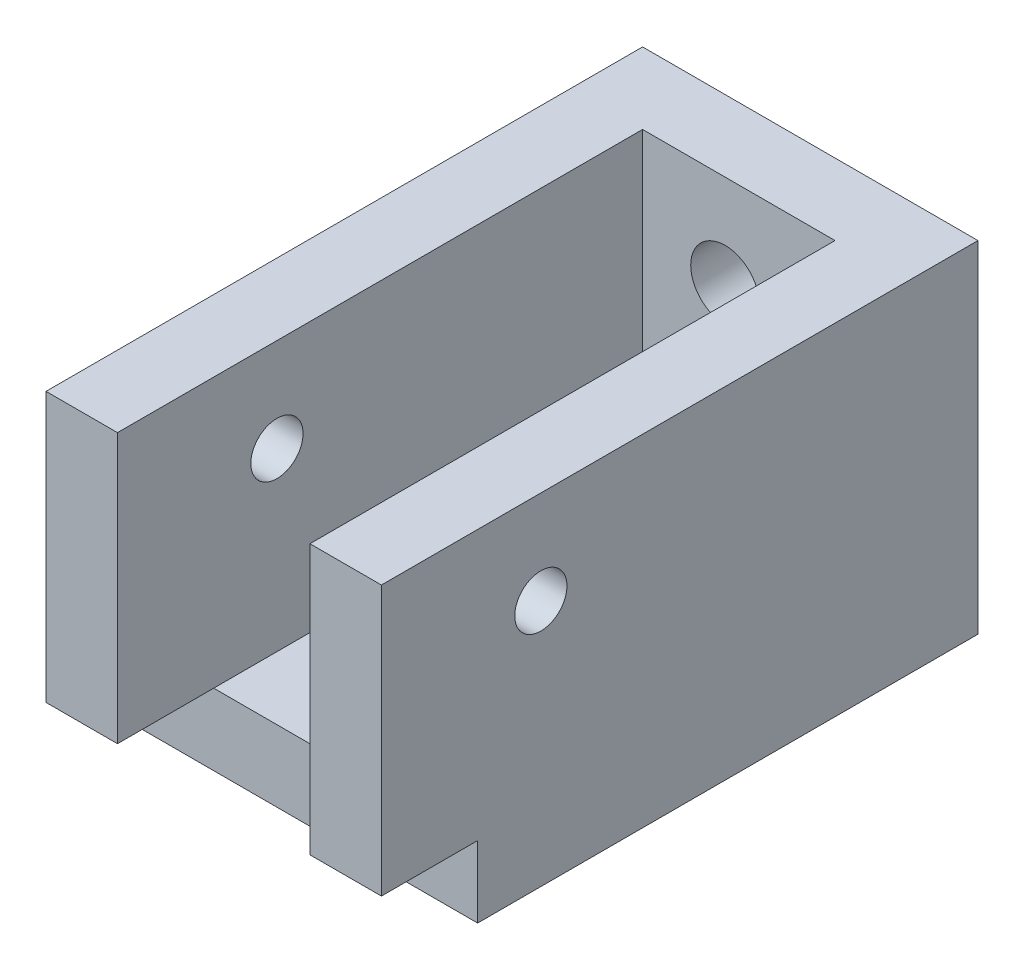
ISO-10303-21;
HEADER;
FILE_DESCRIPTION(('STEP AP214'),'2;1');
FILE_NAME('part.step','',(''),(''),'','','');
FILE_SCHEMA(('AUTOMOTIVE_DESIGN { 1 0 10303 214 1 1 1 1 }'));
ENDSEC;
DATA;
#1=APPLICATION_CONTEXT('core data for automotive mechanical design processes');
#2=APPLICATION_PROTOCOL_DEFINITION('international standard','automotive_design',2000,#1);
#3=PRODUCT_CONTEXT('',#1,'mechanical');
#4=PRODUCT('Part','Part','',(#3));
#5=PRODUCT_RELATED_PRODUCT_CATEGORY('part','',(#4));
#6=PRODUCT_DEFINITION_FORMATION('','',#4);
#7=PRODUCT_DEFINITION_CONTEXT('part definition',#1,'design');
#8=PRODUCT_DEFINITION('design','',#6,#7);
#9=PRODUCT_DEFINITION_SHAPE('','',#8);
#10=(LENGTH_UNIT() NAMED_UNIT(*) SI_UNIT(.MILLI.,.METRE.));
#11=(NAMED_UNIT(*) PLANE_ANGLE_UNIT() SI_UNIT($,.RADIAN.));
#12=(NAMED_UNIT(*) SI_UNIT($,.STERADIAN.) SOLID_ANGLE_UNIT());
#13=UNCERTAINTY_MEASURE_WITH_UNIT(LENGTH_MEASURE(1.E-05),#10,'distance_accuracy_value','');
#14=(GEOMETRIC_REPRESENTATION_CONTEXT(3) GLOBAL_UNCERTAINTY_ASSIGNED_CONTEXT((#13)) GLOBAL_UNIT_ASSIGNED_CONTEXT((#10,
#11,#12)) REPRESENTATION_CONTEXT('',''));
#15=CARTESIAN_POINT('',(0.,0.,0.));
#16=DIRECTION('',(0.,0.,1.));
#17=DIRECTION('',(1.,0.,0.));
#18=AXIS2_PLACEMENT_3D('',#15,#16,#17);
#19=CARTESIAN_POINT('',(0.,124.,26.));
#20=DIRECTION('',(0.,0.,-1.));
#21=DIRECTION('',(-1.,0.,0.));
#22=AXIS2_PLACEMENT_3D('',#19,#20,#21);
#23=PLANE('',#22);
#24=CARTESIAN_POINT('',(56.,90.,26.));
#25=DIRECTION('',(0.,0.,-1.));
#26=DIRECTION('',(-1.,0.,0.));
#27=AXIS2_PLACEMENT_3D('',#24,#25,#26);
#28=CIRCLE('',#27,12.5);
#29=CARTESIAN_POINT('',(43.5,90.,26.));
#30=VERTEX_POINT('',#29);
#31=EDGE_CURVE('E139',#30,#30,#28,.T.);
#32=ORIENTED_EDGE('',*,*,#31,.T.);
#33=EDGE_LOOP('',(#32));
#34=FACE_BOUND('',#33,.T.);
#35=DIRECTION('',(-1.,0.,0.));
#36=VECTOR('',#35,1.);
#37=CARTESIAN_POINT('',(0.,26.,26.));
#38=LINE('',#37,#36);
#39=CARTESIAN_POINT('',(96.,26.,26.));
#40=VERTEX_POINT('',#39);
#41=CARTESIAN_POINT('',(26.,26.,26.));
#42=VERTEX_POINT('',#41);
#43=EDGE_CURVE('E136',#40,#42,#38,.T.);
#44=ORIENTED_EDGE('',*,*,#43,.F.);
#45=DIRECTION('',(0.,-1.,0.));
#46=VECTOR('',#45,1.);
#47=CARTESIAN_POINT('',(96.,124.,26.));
#48=LINE('',#47,#46);
#49=CARTESIAN_POINT('',(96.,124.,26.));
#50=VERTEX_POINT('',#49);
#51=EDGE_CURVE('E152',#50,#40,#48,.T.);
#52=ORIENTED_EDGE('',*,*,#51,.F.);
#53=DIRECTION('',(-1.,0.,0.));
#54=VECTOR('',#53,1.);
#55=CARTESIAN_POINT('',(0.,124.,26.));
#56=LINE('',#55,#54);
#57=CARTESIAN_POINT('',(26.,124.,26.));
#58=VERTEX_POINT('',#57);
#59=EDGE_CURVE('E198',#50,#58,#56,.T.);
#60=ORIENTED_EDGE('',*,*,#59,.T.);
#61=DIRECTION('',(0.,1.,0.));
#62=VECTOR('',#61,1.);
#63=CARTESIAN_POINT('',(26.,124.,26.));
#64=LINE('',#63,#62);
#65=EDGE_CURVE('E173',#42,#58,#64,.T.);
#66=ORIENTED_EDGE('',*,*,#65,.F.);
#67=EDGE_LOOP('',(#44,#52,#60,#66));
#68=FACE_BOUND('',#67,.T.);
#69=ADVANCED_FACE('F34',(#34,#68),#23,.F.);
#70=CARTESIAN_POINT('',(0.,26.,217.));
#71=DIRECTION('',(0.,1.,0.));
#72=DIRECTION('',(0.,0.,1.));
#73=AXIS2_PLACEMENT_3D('',#70,#71,#72);
#74=PLANE('',#73);
#75=DIRECTION('',(-1.,0.,0.));
#76=VECTOR('',#75,1.);
#77=CARTESIAN_POINT('',(0.,26.,182.));
#78=LINE('',#77,#76);
#79=CARTESIAN_POINT('',(26.,26.,182.));
#80=VERTEX_POINT('',#79);
#81=CARTESIAN_POINT('',(0.,26.,182.));
#82=VERTEX_POINT('',#81);
#83=EDGE_CURVE('E55',#80,#82,#78,.T.);
#84=ORIENTED_EDGE('',*,*,#83,.F.);
#85=DIRECTION('',(0.,0.,-1.));
#86=VECTOR('',#85,1.);
#87=CARTESIAN_POINT('',(26.,26.,217.));
#88=LINE('',#87,#86);
#89=CARTESIAN_POINT('',(26.,26.,217.));
#90=VERTEX_POINT('',#89);
#91=EDGE_CURVE('E187',#90,#80,#88,.T.);
#92=ORIENTED_EDGE('',*,*,#91,.F.);
#93=DIRECTION('',(1.,0.,0.));
#94=VECTOR('',#93,1.);
#95=CARTESIAN_POINT('',(0.,26.,217.));
#96=LINE('',#95,#94);
#97=CARTESIAN_POINT('',(0.,26.,217.));
#98=VERTEX_POINT('',#97);
#99=EDGE_CURVE('E177',#98,#90,#96,.T.);
#100=ORIENTED_EDGE('',*,*,#99,.F.);
#101=DIRECTION('',(0.,0.,-1.));
#102=VECTOR('',#101,1.);
#103=CARTESIAN_POINT('',(0.,26.,217.));
#104=LINE('',#103,#102);
#105=EDGE_CURVE('E51',#98,#82,#104,.T.);
#106=ORIENTED_EDGE('',*,*,#105,.T.);
#107=EDGE_LOOP('',(#84,#92,#100,#106));
#108=FACE_BOUND('',#107,.T.);
#109=ADVANCED_FACE('F263',(#108),#74,.F.);
#110=CARTESIAN_POINT('',(122.,26.,217.));
#111=DIRECTION('',(0.,1.,0.));
#112=DIRECTION('',(-1.,0.,0.));
#113=AXIS2_PLACEMENT_3D('',#110,#111,#112);
#114=PLANE('',#113);
#115=CARTESIAN_POINT('',(122.,26.,182.));
#116=VERTEX_POINT('',#115);
#117=CARTESIAN_POINT('',(96.,26.,182.));
#118=VERTEX_POINT('',#117);
#119=EDGE_CURVE('E145',#116,#118,#78,.T.);
#120=ORIENTED_EDGE('',*,*,#119,.F.);
#121=DIRECTION('',(0.,0.,-1.));
#122=VECTOR('',#121,1.);
#123=CARTESIAN_POINT('',(122.,26.,217.));
#124=LINE('',#123,#122);
#125=CARTESIAN_POINT('',(122.,26.,217.));
#126=VERTEX_POINT('',#125);
#127=EDGE_CURVE('E162',#126,#116,#124,.T.);
#128=ORIENTED_EDGE('',*,*,#127,.F.);
#129=DIRECTION('',(1.,0.,0.));
#130=VECTOR('',#129,1.);
#131=CARTESIAN_POINT('',(122.,26.,217.));
#132=LINE('',#131,#130);
#133=CARTESIAN_POINT('',(96.,26.,217.));
#134=VERTEX_POINT('',#133);
#135=EDGE_CURVE('E160',#134,#126,#132,.T.);
#136=ORIENTED_EDGE('',*,*,#135,.F.);
#137=DIRECTION('',(0.,0.,-1.));
#138=VECTOR('',#137,1.);
#139=CARTESIAN_POINT('',(96.,26.,217.));
#140=LINE('',#139,#138);
#141=EDGE_CURVE('E168',#134,#118,#140,.T.);
#142=ORIENTED_EDGE('',*,*,#141,.T.);
#143=EDGE_LOOP('',(#120,#128,#136,#142));
#144=FACE_BOUND('',#143,.T.);
#145=ADVANCED_FACE('F224',(#144),#114,.F.);
#146=CARTESIAN_POINT('',(0.,0.,26.));
#147=DIRECTION('',(1.,0.,0.));
#148=DIRECTION('',(0.,0.,-1.));
#149=AXIS2_PLACEMENT_3D('',#146,#147,#148);
#150=PLANE('',#149);
#151=CARTESIAN_POINT('',(0.,90.,159.));
#152=DIRECTION('',(-1.,0.,0.));
#153=DIRECTION('',(0.,0.,1.));
#154=AXIS2_PLACEMENT_3D('',#151,#152,#153);
#155=CIRCLE('',#154,9.50000000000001);
#156=CARTESIAN_POINT('',(0.,90.,168.5));
#157=VERTEX_POINT('',#156);
#158=EDGE_CURVE('E299',#157,#157,#155,.T.);
#159=ORIENTED_EDGE('',*,*,#158,.F.);
#160=EDGE_LOOP('',(#159));
#161=FACE_BOUND('',#160,.T.);
#162=DIRECTION('',(0.,0.,-1.));
#163=VECTOR('',#162,1.);
#164=CARTESIAN_POINT('',(0.,0.,26.));
#165=LINE('',#164,#163);
#166=CARTESIAN_POINT('',(0.,0.,182.));
#167=VERTEX_POINT('',#166);
#168=CARTESIAN_POINT('',(0.,0.,0.));
#169=VERTEX_POINT('',#168);
#170=EDGE_CURVE('E11',#167,#169,#165,.T.);
#171=ORIENTED_EDGE('',*,*,#170,.F.);
#172=DIRECTION('',(0.,-1.,0.));
#173=VECTOR('',#172,1.);
#174=CARTESIAN_POINT('',(0.,0.,182.));
#175=LINE('',#174,#173);
#176=EDGE_CURVE('E120',#82,#167,#175,.T.);
#177=ORIENTED_EDGE('',*,*,#176,.F.);
#178=ORIENTED_EDGE('',*,*,#105,.F.);
#179=DIRECTION('',(0.,-1.,0.));
#180=VECTOR('',#179,1.);
#181=CARTESIAN_POINT('',(0.,124.,217.));
#182=LINE('',#181,#180);
#183=CARTESIAN_POINT('',(0.,124.,217.));
#184=VERTEX_POINT('',#183);
#185=EDGE_CURVE('E174',#184,#98,#182,.T.);
#186=ORIENTED_EDGE('',*,*,#185,.F.);
#187=DIRECTION('',(0.,0.,-1.));
#188=VECTOR('',#187,1.);
#189=CARTESIAN_POINT('',(0.,124.,26.));
#190=LINE('',#189,#188);
#191=CARTESIAN_POINT('',(0.,124.,0.));
#192=VERTEX_POINT('',#191);
#193=EDGE_CURVE('E199',#184,#192,#190,.T.);
#194=ORIENTED_EDGE('',*,*,#193,.T.);
#195=DIRECTION('',(0.,-1.,0.));
#196=VECTOR('',#195,1.);
#197=CARTESIAN_POINT('',(0.,0.,0.));
#198=LINE('',#197,#196);
#199=EDGE_CURVE('E123',#192,#169,#198,.T.);
#200=ORIENTED_EDGE('',*,*,#199,.T.);
#201=EDGE_LOOP('',(#171,#177,#178,#186,#194,#200));
#202=FACE_BOUND('',#201,.T.);
#203=ADVANCED_FACE('F36',(#161,#202),#150,.F.);
#204=CARTESIAN_POINT('',(0.,0.,26.));
#205=DIRECTION('',(0.,1.,0.));
#206=DIRECTION('',(0.,0.,1.));
#207=AXIS2_PLACEMENT_3D('',#204,#205,#206);
#208=PLANE('',#207);
#209=DIRECTION('',(1.,0.,0.));
#210=VECTOR('',#209,1.);
#211=CARTESIAN_POINT('',(0.,0.,0.));
#212=LINE('',#211,#210);
#213=CARTESIAN_POINT('',(122.,0.,0.));
#214=VERTEX_POINT('',#213);
#215=EDGE_CURVE('E204',#169,#214,#212,.T.);
#216=ORIENTED_EDGE('',*,*,#215,.T.);
#217=DIRECTION('',(0.,0.,-1.));
#218=VECTOR('',#217,1.);
#219=CARTESIAN_POINT('',(122.,0.,26.));
#220=LINE('',#219,#218);
#221=CARTESIAN_POINT('',(122.,0.,182.));
#222=VERTEX_POINT('',#221);
#223=EDGE_CURVE('E43',#222,#214,#220,.T.);
#224=ORIENTED_EDGE('',*,*,#223,.F.);
#225=DIRECTION('',(1.,0.,0.));
#226=VECTOR('',#225,1.);
#227=CARTESIAN_POINT('',(0.,0.,182.));
#228=LINE('',#227,#226);
#229=EDGE_CURVE('E126',#167,#222,#228,.T.);
#230=ORIENTED_EDGE('',*,*,#229,.F.);
#231=ORIENTED_EDGE('',*,*,#170,.T.);
#232=EDGE_LOOP('',(#216,#224,#230,#231));
#233=FACE_BOUND('',#232,.T.);
#234=ADVANCED_FACE('F127',(#233),#208,.F.);
#235=CARTESIAN_POINT('',(122.,0.,26.));
#236=DIRECTION('',(-1.,0.,0.));
#237=DIRECTION('',(0.,0.,1.));
#238=AXIS2_PLACEMENT_3D('',#235,#236,#237);
#239=PLANE('',#238);
#240=CARTESIAN_POINT('',(122.,90.,159.));
#241=DIRECTION('',(-1.,0.,0.));
#242=DIRECTION('',(0.,0.,1.));
#243=AXIS2_PLACEMENT_3D('',#240,#241,#242);
#244=CIRCLE('',#243,9.50000000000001);
#245=CARTESIAN_POINT('',(122.,90.,168.5));
#246=VERTEX_POINT('',#245);
#247=EDGE_CURVE('E307',#246,#246,#244,.T.);
#248=ORIENTED_EDGE('',*,*,#247,.T.);
#249=EDGE_LOOP('',(#248));
#250=FACE_BOUND('',#249,.T.);
#251=DIRECTION('',(0.,1.,0.));
#252=VECTOR('',#251,1.);
#253=CARTESIAN_POINT('',(122.,0.,0.));
#254=LINE('',#253,#252);
#255=CARTESIAN_POINT('',(122.,124.,0.));
#256=VERTEX_POINT('',#255);
#257=EDGE_CURVE('E206',#214,#256,#254,.T.);
#258=ORIENTED_EDGE('',*,*,#257,.T.);
#259=DIRECTION('',(0.,0.,-1.));
#260=VECTOR('',#259,1.);
#261=CARTESIAN_POINT('',(122.,124.,26.));
#262=LINE('',#261,#260);
#263=CARTESIAN_POINT('',(122.,124.,217.));
#264=VERTEX_POINT('',#263);
#265=EDGE_CURVE('E210',#264,#256,#262,.T.);
#266=ORIENTED_EDGE('',*,*,#265,.F.);
#267=DIRECTION('',(0.,1.,0.));
#268=VECTOR('',#267,1.);
#269=CARTESIAN_POINT('',(122.,124.,217.));
#270=LINE('',#269,#268);
#271=EDGE_CURVE('E153',#126,#264,#270,.T.);
#272=ORIENTED_EDGE('',*,*,#271,.F.);
#273=ORIENTED_EDGE('',*,*,#127,.T.);
#274=DIRECTION('',(0.,1.,0.));
#275=VECTOR('',#274,1.);
#276=CARTESIAN_POINT('',(122.,0.,182.));
#277=LINE('',#276,#275);
#278=EDGE_CURVE('E132',#222,#116,#277,.T.);
#279=ORIENTED_EDGE('',*,*,#278,.F.);
#280=ORIENTED_EDGE('',*,*,#223,.T.);
#281=EDGE_LOOP('',(#258,#266,#272,#273,#279,#280));
#282=FACE_BOUND('',#281,.T.);
#283=ADVANCED_FACE('F230',(#250,#282),#239,.F.);
#284=CARTESIAN_POINT('',(0.,124.,26.));
#285=DIRECTION('',(0.,-1.,0.));
#286=DIRECTION('',(0.,0.,-1.));
#287=AXIS2_PLACEMENT_3D('',#284,#285,#286);
#288=PLANE('',#287);
#289=DIRECTION('',(-1.,0.,0.));
#290=VECTOR('',#289,1.);
#291=CARTESIAN_POINT('',(0.,124.,0.));
#292=LINE('',#291,#290);
#293=EDGE_CURVE('E200',#256,#192,#292,.T.);
#294=ORIENTED_EDGE('',*,*,#293,.T.);
#295=ORIENTED_EDGE('',*,*,#193,.F.);
#296=DIRECTION('',(-1.,0.,0.));
#297=VECTOR('',#296,1.);
#298=CARTESIAN_POINT('',(0.,124.,217.));
#299=LINE('',#298,#297);
#300=CARTESIAN_POINT('',(26.,124.,217.));
#301=VERTEX_POINT('',#300);
#302=EDGE_CURVE('E181',#301,#184,#299,.T.);
#303=ORIENTED_EDGE('',*,*,#302,.F.);
#304=DIRECTION('',(0.,0.,-1.));
#305=VECTOR('',#304,1.);
#306=CARTESIAN_POINT('',(26.,124.,217.));
#307=LINE('',#306,#305);
#308=EDGE_CURVE('E184',#301,#58,#307,.T.);
#309=ORIENTED_EDGE('',*,*,#308,.T.);
#310=ORIENTED_EDGE('',*,*,#59,.F.);
#311=DIRECTION('',(0.,0.,-1.));
#312=VECTOR('',#311,1.);
#313=CARTESIAN_POINT('',(96.,124.,217.));
#314=LINE('',#313,#312);
#315=CARTESIAN_POINT('',(96.,124.,217.));
#316=VERTEX_POINT('',#315);
#317=EDGE_CURVE('E170',#316,#50,#314,.T.);
#318=ORIENTED_EDGE('',*,*,#317,.F.);
#319=DIRECTION('',(-1.,0.,0.));
#320=VECTOR('',#319,1.);
#321=CARTESIAN_POINT('',(122.,124.,217.));
#322=LINE('',#321,#320);
#323=EDGE_CURVE('E156',#264,#316,#322,.T.);
#324=ORIENTED_EDGE('',*,*,#323,.F.);
#325=ORIENTED_EDGE('',*,*,#265,.T.);
#326=EDGE_LOOP('',(#294,#295,#303,#309,#310,#318,#324,#325));
#327=FACE_BOUND('',#326,.T.);
#328=ADVANCED_FACE('F242',(#327),#288,.F.);
#329=CARTESIAN_POINT('',(0.,124.,0.));
#330=DIRECTION('',(0.,0.,-1.));
#331=DIRECTION('',(-1.,0.,0.));
#332=AXIS2_PLACEMENT_3D('',#329,#330,#331);
#333=PLANE('',#332);
#334=CARTESIAN_POINT('',(56.,90.,0.));
#335=DIRECTION('',(0.,0.,-1.));
#336=DIRECTION('',(-1.,0.,0.));
#337=AXIS2_PLACEMENT_3D('',#334,#335,#336);
#338=CIRCLE('',#337,12.5);
#339=CARTESIAN_POINT('',(43.5,90.,0.));
#340=VERTEX_POINT('',#339);
#341=EDGE_CURVE('E303',#340,#340,#338,.T.);
#342=ORIENTED_EDGE('',*,*,#341,.F.);
#343=EDGE_LOOP('',(#342));
#344=FACE_BOUND('',#343,.T.);
#345=ORIENTED_EDGE('',*,*,#199,.F.);
#346=ORIENTED_EDGE('',*,*,#293,.F.);
#347=ORIENTED_EDGE('',*,*,#257,.F.);
#348=ORIENTED_EDGE('',*,*,#215,.F.);
#349=EDGE_LOOP('',(#345,#346,#347,#348));
#350=FACE_BOUND('',#349,.T.);
#351=ADVANCED_FACE('F248',(#344,#350),#333,.T.);
#352=CARTESIAN_POINT('',(26.,124.,217.));
#353=DIRECTION('',(-1.,0.,0.));
#354=DIRECTION('',(0.,0.,1.));
#355=AXIS2_PLACEMENT_3D('',#352,#353,#354);
#356=PLANE('',#355);
#357=CARTESIAN_POINT('',(26.,90.,159.));
#358=DIRECTION('',(-1.,0.,0.));
#359=DIRECTION('',(0.,0.,1.));
#360=AXIS2_PLACEMENT_3D('',#357,#358,#359);
#361=CIRCLE('',#360,9.50000000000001);
#362=CARTESIAN_POINT('',(26.,90.,168.5));
#363=VERTEX_POINT('',#362);
#364=EDGE_CURVE('E302',#363,#363,#361,.T.);
#365=ORIENTED_EDGE('',*,*,#364,.T.);
#366=EDGE_LOOP('',(#365));
#367=FACE_BOUND('',#366,.T.);
#368=ORIENTED_EDGE('',*,*,#65,.T.);
#369=ORIENTED_EDGE('',*,*,#308,.F.);
#370=DIRECTION('',(0.,1.,0.));
#371=VECTOR('',#370,1.);
#372=CARTESIAN_POINT('',(26.,124.,217.));
#373=LINE('',#372,#371);
#374=EDGE_CURVE('E179',#90,#301,#373,.T.);
#375=ORIENTED_EDGE('',*,*,#374,.F.);
#376=ORIENTED_EDGE('',*,*,#91,.T.);
#377=DIRECTION('',(0.,0.,1.));
#378=VECTOR('',#377,1.);
#379=CARTESIAN_POINT('',(26.,26.,217.));
#380=LINE('',#379,#378);
#381=EDGE_CURVE('E147',#42,#80,#380,.T.);
#382=ORIENTED_EDGE('',*,*,#381,.F.);
#383=EDGE_LOOP('',(#368,#369,#375,#376,#382));
#384=FACE_BOUND('',#383,.T.);
#385=ADVANCED_FACE('F215',(#367,#384),#356,.F.);
#386=CARTESIAN_POINT('',(0.,26.,217.));
#387=DIRECTION('',(0.,0.,1.));
#388=DIRECTION('',(1.,0.,0.));
#389=AXIS2_PLACEMENT_3D('',#386,#387,#388);
#390=PLANE('',#389);
#391=ORIENTED_EDGE('',*,*,#185,.T.);
#392=ORIENTED_EDGE('',*,*,#99,.T.);
#393=ORIENTED_EDGE('',*,*,#374,.T.);
#394=ORIENTED_EDGE('',*,*,#302,.T.);
#395=EDGE_LOOP('',(#391,#392,#393,#394));
#396=FACE_BOUND('',#395,.T.);
#397=ADVANCED_FACE('F245',(#396),#390,.T.);
#398=CARTESIAN_POINT('',(96.,124.,217.));
#399=DIRECTION('',(1.,0.,0.));
#400=DIRECTION('',(0.,0.,-1.));
#401=AXIS2_PLACEMENT_3D('',#398,#399,#400);
#402=PLANE('',#401);
#403=CARTESIAN_POINT('',(96.,90.,159.));
#404=DIRECTION('',(1.,0.,0.));
#405=DIRECTION('',(0.,0.,-1.));
#406=AXIS2_PLACEMENT_3D('',#403,#404,#405);
#407=CIRCLE('',#406,9.50000000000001);
#408=CARTESIAN_POINT('',(96.,90.,168.5));
#409=VERTEX_POINT('',#408);
#410=EDGE_CURVE('E38',#409,#409,#407,.T.);
#411=ORIENTED_EDGE('',*,*,#410,.T.);
#412=EDGE_LOOP('',(#411));
#413=FACE_BOUND('',#412,.T.);
#414=ORIENTED_EDGE('',*,*,#51,.T.);
#415=EDGE_CURVE('E167',#118,#40,#140,.T.);
#416=ORIENTED_EDGE('',*,*,#415,.F.);
#417=ORIENTED_EDGE('',*,*,#141,.F.);
#418=DIRECTION('',(0.,-1.,0.));
#419=VECTOR('',#418,1.);
#420=CARTESIAN_POINT('',(96.,124.,217.));
#421=LINE('',#420,#419);
#422=EDGE_CURVE('E158',#316,#134,#421,.T.);
#423=ORIENTED_EDGE('',*,*,#422,.F.);
#424=ORIENTED_EDGE('',*,*,#317,.T.);
#425=EDGE_LOOP('',(#414,#416,#417,#423,#424));
#426=FACE_BOUND('',#425,.T.);
#427=ADVANCED_FACE('F237',(#413,#426),#402,.F.);
#428=CARTESIAN_POINT('',(122.,124.,217.));
#429=DIRECTION('',(0.,0.,-1.));
#430=DIRECTION('',(-1.,0.,0.));
#431=AXIS2_PLACEMENT_3D('',#428,#429,#430);
#432=PLANE('',#431);
#433=ORIENTED_EDGE('',*,*,#271,.T.);
#434=ORIENTED_EDGE('',*,*,#323,.T.);
#435=ORIENTED_EDGE('',*,*,#422,.T.);
#436=ORIENTED_EDGE('',*,*,#135,.T.);
#437=EDGE_LOOP('',(#433,#434,#435,#436));
#438=FACE_BOUND('',#437,.T.);
#439=ADVANCED_FACE('F233',(#438),#432,.F.);
#440=CARTESIAN_POINT('',(0.,26.,182.));
#441=DIRECTION('',(0.,-1.,0.));
#442=DIRECTION('',(0.,0.,-1.));
#443=AXIS2_PLACEMENT_3D('',#440,#441,#442);
#444=PLANE('',#443);
#445=ORIENTED_EDGE('',*,*,#43,.T.);
#446=ORIENTED_EDGE('',*,*,#381,.T.);
#447=EDGE_CURVE('E148',#118,#80,#78,.T.);
#448=ORIENTED_EDGE('',*,*,#447,.F.);
#449=ORIENTED_EDGE('',*,*,#415,.T.);
#450=EDGE_LOOP('',(#445,#446,#448,#449));
#451=FACE_BOUND('',#450,.T.);
#452=ADVANCED_FACE('F220',(#451),#444,.F.);
#453=CARTESIAN_POINT('',(0.,26.,182.));
#454=DIRECTION('',(0.,0.,-1.));
#455=DIRECTION('',(-1.,0.,0.));
#456=AXIS2_PLACEMENT_3D('',#453,#454,#455);
#457=PLANE('',#456);
#458=ORIENTED_EDGE('',*,*,#176,.T.);
#459=ORIENTED_EDGE('',*,*,#229,.T.);
#460=ORIENTED_EDGE('',*,*,#278,.T.);
#461=ORIENTED_EDGE('',*,*,#119,.T.);
#462=ORIENTED_EDGE('',*,*,#447,.T.);
#463=ORIENTED_EDGE('',*,*,#83,.T.);
#464=EDGE_LOOP('',(#458,#459,#460,#461,#462,#463));
#465=FACE_BOUND('',#464,.T.);
#466=ADVANCED_FACE('F134',(#465),#457,.F.);
#467=CARTESIAN_POINT('',(56.,90.,217.000025));
#468=DIRECTION('',(0.,0.,-1.));
#469=DIRECTION('',(-1.,0.,0.));
#470=AXIS2_PLACEMENT_3D('',#467,#468,#469);
#471=CYLINDRICAL_SURFACE('',#470,12.5);
#472=ORIENTED_EDGE('',*,*,#341,.T.);
#473=EDGE_LOOP('',(#472));
#474=FACE_BOUND('',#473,.T.);
#475=ORIENTED_EDGE('',*,*,#31,.F.);
#476=EDGE_LOOP('',(#475));
#477=FACE_BOUND('',#476,.T.);
#478=ADVANCED_FACE('F284',(#474,#477),#471,.F.);
#479=CARTESIAN_POINT('',(122.,90.,159.));
#480=DIRECTION('',(-1.,0.,0.));
#481=DIRECTION('',(0.,0.,1.));
#482=AXIS2_PLACEMENT_3D('',#479,#480,#481);
#483=CYLINDRICAL_SURFACE('',#482,9.50000000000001);
#484=CARTESIAN_POINT('',(122.,90.,168.5));
#485=CARTESIAN_POINT('',(121.729166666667,90.,168.5));
#486=CARTESIAN_POINT('',(121.458333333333,90.,168.5));
#487=CARTESIAN_POINT('',(120.916666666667,90.,168.5));
#488=CARTESIAN_POINT('',(120.645833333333,90.,168.5));
#489=CARTESIAN_POINT('',(120.104166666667,90.,168.5));
#490=CARTESIAN_POINT('',(119.833333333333,90.,168.5));
#491=CARTESIAN_POINT('',(119.291666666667,90.,168.5));
#492=CARTESIAN_POINT('',(119.020833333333,90.,168.5));
#493=CARTESIAN_POINT('',(118.479166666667,90.,168.5));
#494=CARTESIAN_POINT('',(118.208333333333,90.,168.5));
#495=CARTESIAN_POINT('',(117.666666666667,90.,168.5));
#496=CARTESIAN_POINT('',(117.395833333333,90.,168.5));
#497=CARTESIAN_POINT('',(116.854166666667,90.,168.5));
#498=CARTESIAN_POINT('',(116.583333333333,90.,168.5));
#499=CARTESIAN_POINT('',(116.041666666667,90.,168.5));
#500=CARTESIAN_POINT('',(115.770833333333,90.,168.5));
#501=CARTESIAN_POINT('',(115.229166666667,90.,168.5));
#502=CARTESIAN_POINT('',(114.958333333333,90.,168.5));
#503=CARTESIAN_POINT('',(114.416666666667,90.,168.5));
#504=CARTESIAN_POINT('',(114.145833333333,90.,168.5));
#505=CARTESIAN_POINT('',(113.604166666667,90.,168.5));
#506=CARTESIAN_POINT('',(113.333333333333,90.,168.5));
#507=CARTESIAN_POINT('',(112.791666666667,90.,168.5));
#508=CARTESIAN_POINT('',(112.520833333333,90.,168.5));
#509=CARTESIAN_POINT('',(111.979166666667,90.,168.5));
#510=CARTESIAN_POINT('',(111.708333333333,90.,168.5));
#511=CARTESIAN_POINT('',(111.166666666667,90.,168.5));
#512=CARTESIAN_POINT('',(110.895833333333,90.,168.5));
#513=CARTESIAN_POINT('',(110.354166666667,90.,168.5));
#514=CARTESIAN_POINT('',(110.083333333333,90.,168.5));
#515=CARTESIAN_POINT('',(109.541666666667,90.,168.5));
#516=CARTESIAN_POINT('',(109.270833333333,90.,168.5));
#517=CARTESIAN_POINT('',(108.729166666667,90.,168.5));
#518=CARTESIAN_POINT('',(108.458333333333,90.,168.5));
#519=CARTESIAN_POINT('',(107.916666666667,90.,168.5));
#520=CARTESIAN_POINT('',(107.645833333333,90.,168.5));
#521=CARTESIAN_POINT('',(107.104166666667,90.,168.5));
#522=CARTESIAN_POINT('',(106.833333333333,90.,168.5));
#523=CARTESIAN_POINT('',(106.291666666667,90.,168.5));
#524=CARTESIAN_POINT('',(106.020833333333,90.,168.5));
#525=CARTESIAN_POINT('',(105.479166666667,90.,168.5));
#526=CARTESIAN_POINT('',(105.208333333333,90.,168.5));
#527=CARTESIAN_POINT('',(104.666666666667,90.,168.5));
#528=CARTESIAN_POINT('',(104.395833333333,90.,168.5));
#529=CARTESIAN_POINT('',(103.854166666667,90.,168.5));
#530=CARTESIAN_POINT('',(103.583333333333,90.,168.5));
#531=CARTESIAN_POINT('',(103.041666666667,90.,168.5));
#532=CARTESIAN_POINT('',(102.770833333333,90.,168.5));
#533=CARTESIAN_POINT('',(102.229166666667,90.,168.5));
#534=CARTESIAN_POINT('',(101.958333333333,90.,168.5));
#535=CARTESIAN_POINT('',(101.416666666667,90.,168.5));
#536=CARTESIAN_POINT('',(101.145833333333,90.,168.5));
#537=CARTESIAN_POINT('',(100.604166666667,90.,168.5));
#538=CARTESIAN_POINT('',(100.333333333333,90.,168.5));
#539=CARTESIAN_POINT('',(99.7916666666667,90.,168.5));
#540=CARTESIAN_POINT('',(99.5208333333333,90.,168.5));
#541=CARTESIAN_POINT('',(98.9791666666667,90.,168.5));
#542=CARTESIAN_POINT('',(98.7083333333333,90.,168.5));
#543=CARTESIAN_POINT('',(98.1666666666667,90.,168.5));
#544=CARTESIAN_POINT('',(97.8958333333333,90.,168.5));
#545=CARTESIAN_POINT('',(97.3541666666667,90.,168.5));
#546=CARTESIAN_POINT('',(97.0833333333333,90.,168.5));
#547=CARTESIAN_POINT('',(96.5416666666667,90.,168.5));
#548=CARTESIAN_POINT('',(96.2708333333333,90.,168.5));
#549=CARTESIAN_POINT('',(96.,90.,168.5));
#550=B_SPLINE_CURVE_WITH_KNOTS('',3,(#484,#485,#486,#487,#488,#489,#490,#491,#492,#493,#494,
#495,#496,#497,#498,#499,#500,#501,#502,#503,#504,#505,#506,#507,#508,#509,#510,#511,#512,#513,
#514,#515,#516,#517,#518,#519,#520,#521,#522,#523,#524,#525,#526,#527,#528,#529,#530,#531,#532,
#533,#534,#535,#536,#537,#538,#539,#540,#541,#542,#543,#544,#545,#546,#547,#548,#549),
.UNSPECIFIED.,.F.,.F.,(4,2,2,2,2,2,2,2,2,2,2,2,2,2,2,2,2,2,2,2,2,2,2,2,2,2,2,2,2,2,2,2,4),(0.,
0.812500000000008,1.625,2.43750000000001,3.25,4.06250000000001,4.875,5.68750000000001,
6.50000000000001,7.31250000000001,8.12500000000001,8.93750000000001,9.75000000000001,10.5625,
11.375,12.1875,13.,13.8125,14.625,15.4375,16.25,17.0625,17.875,18.6875,19.5,20.3125,21.125,
21.9375,22.75,23.5625,24.375,25.1875,26.),.UNSPECIFIED.);
#551=EDGE_CURVE('BSEAM287',#246,#409,#550,.T.);
#552=ORIENTED_EDGE('',*,*,#247,.F.);
#553=ORIENTED_EDGE('',*,*,#410,.F.);
#554=ORIENTED_EDGE('',*,*,#551,.T.);
#555=ORIENTED_EDGE('',*,*,#551,.F.);
#556=EDGE_LOOP('',(#552,#554,#553,#555));
#557=FACE_BOUND('',#556,.T.);
#558=ADVANCED_FACE('F287',(#557),#483,.F.);
#559=CARTESIAN_POINT('',(0.,90.,168.5));
#560=CARTESIAN_POINT('',(0.270833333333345,90.,168.5));
#561=CARTESIAN_POINT('',(0.541666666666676,90.,168.5));
#562=CARTESIAN_POINT('',(1.08333333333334,90.,168.5));
#563=CARTESIAN_POINT('',(1.35416666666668,90.,168.5));
#564=CARTESIAN_POINT('',(1.89583333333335,90.,168.5));
#565=CARTESIAN_POINT('',(2.16666666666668,90.,168.5));
#566=CARTESIAN_POINT('',(2.70833333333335,90.,168.5));
#567=CARTESIAN_POINT('',(2.97916666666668,90.,168.5));
#568=CARTESIAN_POINT('',(3.52083333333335,90.,168.5));
#569=CARTESIAN_POINT('',(3.79166666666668,90.,168.5));
#570=CARTESIAN_POINT('',(4.33333333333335,90.,168.5));
#571=CARTESIAN_POINT('',(4.60416666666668,90.,168.5));
#572=CARTESIAN_POINT('',(5.14583333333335,90.,168.5));
#573=CARTESIAN_POINT('',(5.41666666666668,90.,168.5));
#574=CARTESIAN_POINT('',(5.95833333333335,90.,168.5));
#575=CARTESIAN_POINT('',(6.22916666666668,90.,168.5));
#576=CARTESIAN_POINT('',(6.77083333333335,90.,168.5));
#577=CARTESIAN_POINT('',(7.04166666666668,90.,168.5));
#578=CARTESIAN_POINT('',(7.58333333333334,90.,168.5));
#579=CARTESIAN_POINT('',(7.85416666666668,90.,168.5));
#580=CARTESIAN_POINT('',(8.39583333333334,90.,168.5));
#581=CARTESIAN_POINT('',(8.66666666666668,90.,168.5));
#582=CARTESIAN_POINT('',(9.20833333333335,90.,168.5));
#583=CARTESIAN_POINT('',(9.47916666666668,90.,168.5));
#584=CARTESIAN_POINT('',(10.0208333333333,90.,168.5));
#585=CARTESIAN_POINT('',(10.2916666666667,90.,168.5));
#586=CARTESIAN_POINT('',(10.8333333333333,90.,168.5));
#587=CARTESIAN_POINT('',(11.1041666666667,90.,168.5));
#588=CARTESIAN_POINT('',(11.6458333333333,90.,168.5));
#589=CARTESIAN_POINT('',(11.9166666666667,90.,168.5));
#590=CARTESIAN_POINT('',(12.4583333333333,90.,168.5));
#591=CARTESIAN_POINT('',(12.7291666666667,90.,168.5));
#592=CARTESIAN_POINT('',(13.2708333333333,90.,168.5));
#593=CARTESIAN_POINT('',(13.5416666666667,90.,168.5));
#594=CARTESIAN_POINT('',(14.0833333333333,90.,168.5));
#595=CARTESIAN_POINT('',(14.3541666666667,90.,168.5));
#596=CARTESIAN_POINT('',(14.8958333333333,90.,168.5));
#597=CARTESIAN_POINT('',(15.1666666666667,90.,168.5));
#598=CARTESIAN_POINT('',(15.7083333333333,90.,168.5));
#599=CARTESIAN_POINT('',(15.9791666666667,90.,168.5));
#600=CARTESIAN_POINT('',(16.5208333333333,90.,168.5));
#601=CARTESIAN_POINT('',(16.7916666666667,90.,168.5));
#602=CARTESIAN_POINT('',(17.3333333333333,90.,168.5));
#603=CARTESIAN_POINT('',(17.6041666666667,90.,168.5));
#604=CARTESIAN_POINT('',(18.1458333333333,90.,168.5));
#605=CARTESIAN_POINT('',(18.4166666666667,90.,168.5));
#606=CARTESIAN_POINT('',(18.9583333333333,90.,168.5));
#607=CARTESIAN_POINT('',(19.2291666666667,90.,168.5));
#608=CARTESIAN_POINT('',(19.7708333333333,90.,168.5));
#609=CARTESIAN_POINT('',(20.0416666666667,90.,168.5));
#610=CARTESIAN_POINT('',(20.5833333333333,90.,168.5));
#611=CARTESIAN_POINT('',(20.8541666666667,90.,168.5));
#612=CARTESIAN_POINT('',(21.3958333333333,90.,168.5));
#613=CARTESIAN_POINT('',(21.6666666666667,90.,168.5));
#614=CARTESIAN_POINT('',(22.2083333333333,90.,168.5));
#615=CARTESIAN_POINT('',(22.4791666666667,90.,168.5));
#616=CARTESIAN_POINT('',(23.0208333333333,90.,168.5));
#617=CARTESIAN_POINT('',(23.2916666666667,90.,168.5));
#618=CARTESIAN_POINT('',(23.8333333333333,90.,168.5));
#619=CARTESIAN_POINT('',(24.1041666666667,90.,168.5));
#620=CARTESIAN_POINT('',(24.6458333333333,90.,168.5));
#621=CARTESIAN_POINT('',(24.9166666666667,90.,168.5));
#622=CARTESIAN_POINT('',(25.4583333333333,90.,168.5));
#623=CARTESIAN_POINT('',(25.7291666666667,90.,168.5));
#624=CARTESIAN_POINT('',(26.,90.,168.5));
#625=B_SPLINE_CURVE_WITH_KNOTS('',3,(#559,#560,#561,#562,#563,#564,#565,#566,#567,#568,#569,
#570,#571,#572,#573,#574,#575,#576,#577,#578,#579,#580,#581,#582,#583,#584,#585,#586,#587,#588,
#589,#590,#591,#592,#593,#594,#595,#596,#597,#598,#599,#600,#601,#602,#603,#604,#605,#606,#607,
#608,#609,#610,#611,#612,#613,#614,#615,#616,#617,#618,#619,#620,#621,#622,#623,#624),
.UNSPECIFIED.,.F.,.F.,(4,2,2,2,2,2,2,2,2,2,2,2,2,2,2,2,2,2,2,2,2,2,2,2,2,2,2,2,2,2,2,2,4),(0.,
0.812499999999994,1.625,2.4375,3.25,4.0625,4.875,5.6875,6.50000000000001,7.3125,
8.12499999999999,8.9375,9.74999999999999,10.5625,11.375,12.1875,13.,13.8125,14.625,15.4375,
16.25,17.0625,17.875,18.6875,19.5,20.3125,21.125,21.9375,22.75,23.5625,24.375,25.1875,26.),.UNSPECIFIED.);
#626=EDGE_CURVE('BSEAM289',#157,#363,#625,.T.);
#627=ORIENTED_EDGE('',*,*,#158,.T.);
#628=ORIENTED_EDGE('',*,*,#364,.F.);
#629=ORIENTED_EDGE('',*,*,#626,.T.);
#630=ORIENTED_EDGE('',*,*,#626,.F.);
#631=EDGE_LOOP('',(#627,#629,#628,#630));
#632=FACE_BOUND('',#631,.T.);
#633=ADVANCED_FACE('F289',(#632),#483,.F.);
#634=CLOSED_SHELL('',(#69,#109,#145,#203,#234,#283,#328,#351,#385,#397,#427,#439,#452,#466,#478,
#558,#633));
#635=MANIFOLD_SOLID_BREP('B2',#634);
#636=ADVANCED_BREP_SHAPE_REPRESENTATION('',(#18,#635),#14);
#637=SHAPE_DEFINITION_REPRESENTATION(#9,#636);
ENDSEC;
END-ISO-10303-21;
